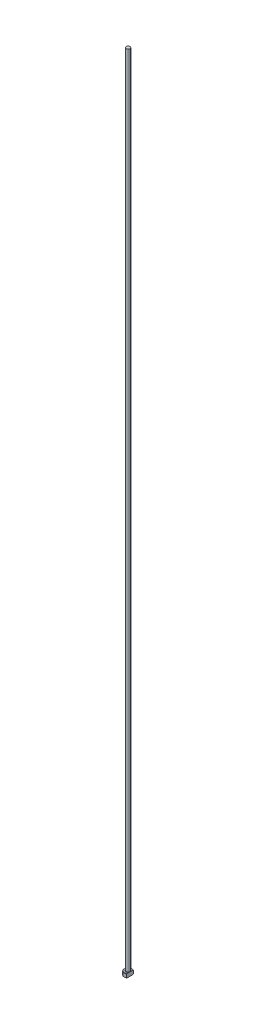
ISO-10303-21;
HEADER;
FILE_DESCRIPTION(('STEP AP214'),'2;1');
FILE_NAME('part.step','',(''),(''),'','','');
FILE_SCHEMA(('AUTOMOTIVE_DESIGN { 1 0 10303 214 1 1 1 1 }'));
ENDSEC;
DATA;
#1=APPLICATION_CONTEXT('core data for automotive mechanical design processes');
#2=APPLICATION_PROTOCOL_DEFINITION('international standard','automotive_design',2000,#1);
#3=PRODUCT_CONTEXT('',#1,'mechanical');
#4=PRODUCT('Part','Part','',(#3));
#5=PRODUCT_RELATED_PRODUCT_CATEGORY('part','',(#4));
#6=PRODUCT_DEFINITION_FORMATION('','',#4);
#7=PRODUCT_DEFINITION_CONTEXT('part definition',#1,'design');
#8=PRODUCT_DEFINITION('design','',#6,#7);
#9=PRODUCT_DEFINITION_SHAPE('','',#8);
#10=(LENGTH_UNIT() NAMED_UNIT(*) SI_UNIT(.MILLI.,.METRE.));
#11=(NAMED_UNIT(*) PLANE_ANGLE_UNIT() SI_UNIT($,.RADIAN.));
#12=(NAMED_UNIT(*) SI_UNIT($,.STERADIAN.) SOLID_ANGLE_UNIT());
#13=UNCERTAINTY_MEASURE_WITH_UNIT(LENGTH_MEASURE(1.E-05),#10,'distance_accuracy_value','');
#14=(GEOMETRIC_REPRESENTATION_CONTEXT(3) GLOBAL_UNCERTAINTY_ASSIGNED_CONTEXT((#13)) GLOBAL_UNIT_ASSIGNED_CONTEXT((#10,
#11,#12)) REPRESENTATION_CONTEXT('',''));
#15=CARTESIAN_POINT('',(0.,0.,0.));
#16=DIRECTION('',(0.,0.,1.));
#17=DIRECTION('',(1.,0.,0.));
#18=AXIS2_PLACEMENT_3D('',#15,#16,#17);
#19=CARTESIAN_POINT('',(0.,0.,0.));
#20=DIRECTION('',(0.,-1.,0.));
#21=DIRECTION('',(0.,0.,-1.));
#22=AXIS2_PLACEMENT_3D('',#19,#20,#21);
#23=PLANE('',#22);
#24=CARTESIAN_POINT('',(0.,0.,0.));
#25=DIRECTION('',(0.,-1.,0.));
#26=DIRECTION('',(0.,0.,-1.));
#27=AXIS2_PLACEMENT_3D('',#24,#25,#26);
#28=CIRCLE('',#27,2.79999999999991);
#29=CARTESIAN_POINT('',(1.49999999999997,0.,2.3643180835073));
#30=VERTEX_POINT('',#29);
#31=CARTESIAN_POINT('',(1.49999999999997,0.,-2.3643180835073));
#32=VERTEX_POINT('',#31);
#33=EDGE_CURVE('E98',#30,#32,#28,.T.);
#34=ORIENTED_EDGE('',*,*,#33,.T.);
#35=DIRECTION('',(0.,0.,1.));
#36=VECTOR('',#35,1.);
#37=CARTESIAN_POINT('',(1.49999999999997,0.,-2.5980762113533));
#38=LINE('',#37,#36);
#39=EDGE_CURVE('E83',#32,#30,#38,.T.);
#40=ORIENTED_EDGE('',*,*,#39,.T.);
#41=EDGE_LOOP('',(#34,#40));
#42=FACE_BOUND('',#41,.T.);
#43=ADVANCED_FACE('F32',(#42),#23,.T.);
#44=CARTESIAN_POINT('',(0.,259.958771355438,0.));
#45=DIRECTION('',(0.,1.,0.));
#46=DIRECTION('',(0.,0.,1.));
#47=AXIS2_PLACEMENT_3D('',#44,#45,#46);
#48=CYLINDRICAL_SURFACE('',#47,2.99999999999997);
#49=CARTESIAN_POINT('',(0.,2.79999999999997,0.));
#50=DIRECTION('',(0.,1.,0.));
#51=DIRECTION('',(0.,0.,1.));
#52=AXIS2_PLACEMENT_3D('',#49,#50,#51);
#53=CIRCLE('',#52,2.99999999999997);
#54=CARTESIAN_POINT('',(1.49999999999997,2.79999999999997,2.5980762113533));
#55=VERTEX_POINT('',#54);
#56=CARTESIAN_POINT('',(1.49999999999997,2.79999999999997,-2.5980762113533));
#57=VERTEX_POINT('',#56);
#58=EDGE_CURVE('E104',#55,#57,#53,.F.);
#59=ORIENTED_EDGE('',*,*,#58,.T.);
#60=DIRECTION('',(0.,-1.,0.));
#61=VECTOR('',#60,1.);
#62=CARTESIAN_POINT('',(1.49999999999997,630.,-2.5980762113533));
#63=LINE('',#62,#61);
#64=CARTESIAN_POINT('',(1.49999999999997,0.200000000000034,-2.5980762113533));
#65=VERTEX_POINT('',#64);
#66=EDGE_CURVE('E183',#57,#65,#63,.T.);
#67=ORIENTED_EDGE('',*,*,#66,.T.);
#68=CARTESIAN_POINT('',(0.,0.200000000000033,0.));
#69=DIRECTION('',(0.,-1.,0.));
#70=DIRECTION('',(0.,0.,-1.));
#71=AXIS2_PLACEMENT_3D('',#68,#69,#70);
#72=CIRCLE('',#71,2.99999999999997);
#73=CARTESIAN_POINT('',(1.49999999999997,0.200000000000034,2.5980762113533));
#74=VERTEX_POINT('',#73);
#75=EDGE_CURVE('E100',#65,#74,#72,.F.);
#76=ORIENTED_EDGE('',*,*,#75,.T.);
#77=DIRECTION('',(0.,-1.,0.));
#78=VECTOR('',#77,1.);
#79=CARTESIAN_POINT('',(1.49999999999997,630.,2.5980762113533));
#80=LINE('',#79,#78);
#81=EDGE_CURVE('E93',#55,#74,#80,.T.);
#82=ORIENTED_EDGE('',*,*,#81,.F.);
#83=EDGE_LOOP('',(#59,#67,#76,#82));
#84=FACE_BOUND('',#83,.T.);
#85=ADVANCED_FACE('F158',(#84),#48,.T.);
#86=CARTESIAN_POINT('',(-2.99999999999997,3.,0.));
#87=DIRECTION('',(0.,1.,0.));
#88=DIRECTION('',(0.,0.,1.));
#89=AXIS2_PLACEMENT_3D('',#86,#87,#88);
#90=PLANE('',#89);
#91=CARTESIAN_POINT('',(0.,3.,0.));
#92=DIRECTION('',(0.,1.,0.));
#93=DIRECTION('',(0.,0.,1.));
#94=AXIS2_PLACEMENT_3D('',#91,#92,#93);
#95=CIRCLE('',#94,2.79999999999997);
#96=CARTESIAN_POINT('',(1.49999999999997,3.,-2.36431808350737));
#97=VERTEX_POINT('',#96);
#98=CARTESIAN_POINT('',(1.49999999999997,3.,2.36431808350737));
#99=VERTEX_POINT('',#98);
#100=EDGE_CURVE('E178',#97,#99,#95,.T.);
#101=ORIENTED_EDGE('',*,*,#100,.T.);
#102=DIRECTION('',(0.,0.,-1.));
#103=VECTOR('',#102,1.);
#104=CARTESIAN_POINT('',(1.49999999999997,3.,0.));
#105=LINE('',#104,#103);
#106=CARTESIAN_POINT('',(1.49999999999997,2.99999999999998,0.799999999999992));
#107=VERTEX_POINT('',#106);
#108=EDGE_CURVE('E57',#99,#107,#105,.T.);
#109=ORIENTED_EDGE('',*,*,#108,.T.);
#110=CARTESIAN_POINT('',(0.,3.,0.));
#111=DIRECTION('',(0.,1.,0.));
#112=DIRECTION('',(0.,0.,1.));
#113=AXIS2_PLACEMENT_3D('',#110,#111,#112);
#114=CIRCLE('',#113,1.69999999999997);
#115=CARTESIAN_POINT('',(1.49999999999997,2.99999999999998,-0.799999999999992));
#116=VERTEX_POINT('',#115);
#117=EDGE_CURVE('E107',#107,#116,#114,.F.);
#118=ORIENTED_EDGE('',*,*,#117,.T.);
#119=EDGE_CURVE('E136',#116,#97,#105,.T.);
#120=ORIENTED_EDGE('',*,*,#119,.T.);
#121=EDGE_LOOP('',(#101,#109,#118,#120));
#122=FACE_BOUND('',#121,.T.);
#123=ADVANCED_FACE('F147',(#122),#90,.T.);
#124=CARTESIAN_POINT('',(0.,3.,0.));
#125=DIRECTION('',(0.,-1.,0.));
#126=DIRECTION('',(0.,0.,-1.));
#127=AXIS2_PLACEMENT_3D('',#124,#125,#126);
#128=CONICAL_SURFACE('',#127,2.79999999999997,0.785398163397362);
#129=ORIENTED_EDGE('',*,*,#58,.F.);
#130=CARTESIAN_POINT('',(1.49999999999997,-0.111741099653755,5.71827621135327));
#131=CARTESIAN_POINT('',(1.49999999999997,0.0136183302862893,5.58866816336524));
#132=CARTESIAN_POINT('',(1.49999999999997,0.138843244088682,5.45892957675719));
#133=CARTESIAN_POINT('',(1.49999999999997,0.388944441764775,5.19911365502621));
#134=CARTESIAN_POINT('',(1.49999999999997,0.513820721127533,5.0690363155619));
#135=CARTESIAN_POINT('',(1.49999999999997,0.76320568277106,4.80840180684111));
#136=CARTESIAN_POINT('',(1.49999999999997,0.88771414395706,4.67784442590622));
#137=CARTESIAN_POINT('',(1.49999999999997,1.13618059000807,4.41620813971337));
#138=CARTESIAN_POINT('',(1.49999999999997,1.26013857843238,4.28512923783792));
#139=CARTESIAN_POINT('',(1.49999999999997,1.50488975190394,4.02490837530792));
#140=CARTESIAN_POINT('',(1.49999999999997,1.62569693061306,3.89577958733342));
#141=CARTESIAN_POINT('',(1.49999999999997,1.86640694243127,3.63668213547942));
#142=CARTESIAN_POINT('',(1.49999999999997,1.98630978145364,3.50671347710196));
#143=CARTESIAN_POINT('',(1.49999999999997,2.22486033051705,3.24567921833));
#144=CARTESIAN_POINT('',(1.49999999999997,2.34350830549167,3.11461386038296));
#145=CARTESIAN_POINT('',(1.49999999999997,2.57907716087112,2.85094268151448));
#146=CARTESIAN_POINT('',(1.49999999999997,2.69599811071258,2.71833692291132));
#147=CARTESIAN_POINT('',(1.49999999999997,2.88262371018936,2.50255231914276));
#148=CARTESIAN_POINT('',(1.49999999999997,2.95312454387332,2.42006293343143));
#149=CARTESIAN_POINT('',(1.49999999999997,3.09287098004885,2.25401084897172));
#150=CARTESIAN_POINT('',(1.49999999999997,3.16211645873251,2.17044804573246));
#151=CARTESIAN_POINT('',(1.49999999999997,3.29964684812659,2.00105967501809));
#152=CARTESIAN_POINT('',(1.49999999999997,3.36791386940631,1.91521952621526));
#153=CARTESIAN_POINT('',(1.49999999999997,3.50205840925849,1.74171392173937));
#154=CARTESIAN_POINT('',(1.49999999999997,3.56793649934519,1.65404891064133));
#155=CARTESIAN_POINT('',(1.49999999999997,3.69728151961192,1.47490236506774));
#156=CARTESIAN_POINT('',(1.49999999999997,3.76069661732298,1.38338308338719));
#157=CARTESIAN_POINT('',(1.49999999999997,3.88239539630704,1.19675661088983));
#158=CARTESIAN_POINT('',(1.49999999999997,3.94067201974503,1.10164473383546));
#159=CARTESIAN_POINT('',(1.49999999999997,4.04841325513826,0.908008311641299));
#160=CARTESIAN_POINT('',(1.49999999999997,4.09797809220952,0.809540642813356));
#161=CARTESIAN_POINT('',(1.49999999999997,4.18432188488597,0.607192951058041));
#162=CARTESIAN_POINT('',(1.49999999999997,4.22114374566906,0.503332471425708));
#163=CARTESIAN_POINT('',(1.49999999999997,4.26099935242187,0.347577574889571));
#164=CARTESIAN_POINT('',(1.49999999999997,4.27157029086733,0.297609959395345));
#165=CARTESIAN_POINT('',(1.49999999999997,4.2879486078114,0.196885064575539));
#166=CARTESIAN_POINT('',(1.49999999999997,4.2937564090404,0.146127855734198));
#167=CARTESIAN_POINT('',(1.49999999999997,4.30019707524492,0.0444388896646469));
#168=CARTESIAN_POINT('',(1.49999999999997,4.30084594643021,-0.00649183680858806));
#169=CARTESIAN_POINT('',(1.49999999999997,4.29696416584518,-0.108155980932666));
#170=CARTESIAN_POINT('',(1.49999999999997,4.29243308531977,-0.158889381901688));
#171=CARTESIAN_POINT('',(1.49999999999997,4.27856915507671,-0.259234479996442));
#172=CARTESIAN_POINT('',(1.49999999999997,4.2692782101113,-0.308852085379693));
#173=CARTESIAN_POINT('',(1.49999999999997,4.24647108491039,-0.407110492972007));
#174=CARTESIAN_POINT('',(1.49999999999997,4.23295324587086,-0.455750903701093));
#175=CARTESIAN_POINT('',(1.49999999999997,4.20226175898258,-0.552149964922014));
#176=CARTESIAN_POINT('',(1.49999999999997,4.18506801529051,-0.599902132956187));
#177=CARTESIAN_POINT('',(1.49999999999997,4.14771387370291,-0.694205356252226));
#178=CARTESIAN_POINT('',(1.49999999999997,4.12755408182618,-0.74075665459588));
#179=CARTESIAN_POINT('',(1.49999999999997,4.06327696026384,-0.879166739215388));
#180=CARTESIAN_POINT('',(1.49999999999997,4.01551721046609,-0.969329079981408));
#181=CARTESIAN_POINT('',(1.49999999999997,3.91367909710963,-1.14604316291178));
#182=CARTESIAN_POINT('',(1.49999999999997,3.85959300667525,-1.23259031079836));
#183=CARTESIAN_POINT('',(1.49999999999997,3.74697968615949,-1.40321348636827));
#184=CARTESIAN_POINT('',(1.49999999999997,3.68843573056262,-1.48727838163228));
#185=CARTESIAN_POINT('',(1.49999999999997,3.56843845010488,-1.65322187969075));
#186=CARTESIAN_POINT('',(1.49999999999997,3.50698656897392,-1.73510153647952));
#187=CARTESIAN_POINT('',(1.49999999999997,3.38115673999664,-1.89829823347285));
#188=CARTESIAN_POINT('',(1.49999999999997,3.31675092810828,-1.97959369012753));
#189=CARTESIAN_POINT('',(1.49999999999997,3.18634068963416,-2.14090082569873));
#190=CARTESIAN_POINT('',(1.49999999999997,3.12033609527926,-2.22091236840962));
#191=CARTESIAN_POINT('',(1.49999999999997,2.92086431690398,-2.4590650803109));
#192=CARTESIAN_POINT('',(1.49999999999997,2.7856266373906,-2.61572090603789));
#193=CARTESIAN_POINT('',(1.49999999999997,2.53554498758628,-2.90006295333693));
#194=CARTESIAN_POINT('',(1.49999999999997,2.42114543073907,-3.02814382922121));
#195=CARTESIAN_POINT('',(1.49999999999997,2.19093557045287,-3.28303767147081));
#196=CARTESIAN_POINT('',(1.49999999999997,2.07512522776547,-3.40985060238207));
#197=CARTESIAN_POINT('',(1.49999999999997,1.72597067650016,-3.7891384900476));
#198=CARTESIAN_POINT('',(1.49999999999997,1.49111760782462,-4.04022177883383));
#199=CARTESIAN_POINT('',(1.49999999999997,1.02882478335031,-4.52992803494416));
#200=CARTESIAN_POINT('',(1.49999999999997,0.801477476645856,-4.76863870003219));
#201=CARTESIAN_POINT('',(1.49999999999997,0.459548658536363,-5.12558036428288));
#202=CARTESIAN_POINT('',(1.49999999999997,0.345484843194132,-5.24430773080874));
#203=CARTESIAN_POINT('',(1.49999999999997,0.11707176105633,-5.48148573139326));
#204=CARTESIAN_POINT('',(1.49999999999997,0.00272249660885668,-5.59993636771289));
#205=CARTESIAN_POINT('',(1.49999999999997,-0.111741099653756,-5.71827621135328));
#206=B_SPLINE_CURVE_WITH_KNOTS('',3,(#130,#131,#132,#133,#134,#135,#136,#137,#138,#139,#140,
#141,#142,#143,#144,#145,#146,#147,#148,#149,#150,#151,#152,#153,#154,#155,#156,#157,#158,#159,
#160,#161,#162,#163,#164,#165,#166,#167,#168,#169,#170,#171,#172,#173,#174,#175,#176,#177,#178,
#179,#180,#181,#182,#183,#184,#185,#186,#187,#188,#189,#190,#191,#192,#193,#194,#195,#196,#197,
#198,#199,#200,#201,#202,#203,#204,#205),.UNSPECIFIED.,.F.,.F.,(4,2,2,2,2,2,2,2,2,2,2,2,2,2,2,2,
2,2,2,2,2,2,2,2,2,2,2,2,2,2,2,2,2,2,2,2,2,4),(0.,0.540943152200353,1.08189327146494,
1.62312052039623,2.16434426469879,2.69482920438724,3.22531067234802,3.7556778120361,
4.28602356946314,4.61155053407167,4.93710943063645,5.26610945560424,5.59503024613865,
5.92894782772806,6.26331713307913,6.59354403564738,6.92264800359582,7.07567478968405,
7.22868799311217,7.38122626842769,7.53377717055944,7.68500755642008,7.83629736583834,
7.98843643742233,8.14054446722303,8.44618799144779,8.75220879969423,9.05944044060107,
9.3665211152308,9.67764287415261,9.98879742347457,10.6095925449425,11.1247803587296,
11.6399825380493,12.6713544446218,13.6603005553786,14.1542238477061,14.6481430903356),.UNSPECIFIED.);
#207=EDGE_CURVE('E135',#55,#99,#206,.T.);
#208=ORIENTED_EDGE('',*,*,#207,.T.);
#209=ORIENTED_EDGE('',*,*,#100,.F.);
#210=EDGE_CURVE('E127',#97,#57,#206,.T.);
#211=ORIENTED_EDGE('',*,*,#210,.T.);
#212=EDGE_LOOP('',(#129,#208,#209,#211));
#213=FACE_BOUND('',#212,.T.);
#214=ADVANCED_FACE('F143',(#213),#128,.T.);
#215=CARTESIAN_POINT('',(0.,0.200000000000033,0.));
#216=DIRECTION('',(0.,1.,0.));
#217=DIRECTION('',(0.,0.,1.));
#218=AXIS2_PLACEMENT_3D('',#215,#216,#217);
#219=CONICAL_SURFACE('',#218,2.99999999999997,0.7853981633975);
#220=ORIENTED_EDGE('',*,*,#75,.F.);
#221=CARTESIAN_POINT('',(1.49999999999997,3.11174109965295,-5.71827621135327));
#222=CARTESIAN_POINT('',(1.49999999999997,2.98638166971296,-5.58866816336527));
#223=CARTESIAN_POINT('',(1.49999999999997,2.86115675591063,-5.45892957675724));
#224=CARTESIAN_POINT('',(1.49999999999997,2.61105555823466,-5.19911365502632));
#225=CARTESIAN_POINT('',(1.49999999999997,2.48617927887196,-5.06903631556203));
#226=CARTESIAN_POINT('',(1.49999999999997,2.23679431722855,-4.8084018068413));
#227=CARTESIAN_POINT('',(1.49999999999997,2.11228585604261,-4.67784442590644));
#228=CARTESIAN_POINT('',(1.49999999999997,1.86381940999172,-4.41620813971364));
#229=CARTESIAN_POINT('',(1.49999999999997,1.73986142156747,-4.28512923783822));
#230=CARTESIAN_POINT('',(1.49999999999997,1.49511024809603,-4.02490837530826));
#231=CARTESIAN_POINT('',(1.49999999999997,1.37430306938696,-3.89577958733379));
#232=CARTESIAN_POINT('',(1.49999999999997,1.13359305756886,-3.63668213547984));
#233=CARTESIAN_POINT('',(1.49999999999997,1.01369021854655,-3.5067134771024));
#234=CARTESIAN_POINT('',(1.49999999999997,0.775139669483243,-3.24567921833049));
#235=CARTESIAN_POINT('',(1.49999999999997,0.656491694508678,-3.11461386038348));
#236=CARTESIAN_POINT('',(1.49999999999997,0.42092283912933,-2.85094268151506));
#237=CARTESIAN_POINT('',(1.49999999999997,0.304001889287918,-2.71833692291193));
#238=CARTESIAN_POINT('',(1.49999999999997,0.117376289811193,-2.50255231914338));
#239=CARTESIAN_POINT('',(1.49999999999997,0.0468754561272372,-2.42006293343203));
#240=CARTESIAN_POINT('',(1.49999999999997,-0.0928709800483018,-2.25401084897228));
#241=CARTESIAN_POINT('',(1.49999999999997,-0.162116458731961,-2.170448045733));
#242=CARTESIAN_POINT('',(1.49999999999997,-0.299646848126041,-2.0010596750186));
#243=CARTESIAN_POINT('',(1.49999999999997,-0.36791386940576,-1.91521952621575));
#244=CARTESIAN_POINT('',(1.49999999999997,-0.502058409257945,-1.74171392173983));
#245=CARTESIAN_POINT('',(1.49999999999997,-0.567936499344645,-1.65404891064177));
#246=CARTESIAN_POINT('',(1.49999999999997,-0.697281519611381,-1.47490236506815));
#247=CARTESIAN_POINT('',(1.49999999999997,-0.760696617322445,-1.38338308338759));
#248=CARTESIAN_POINT('',(1.49999999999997,-0.882395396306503,-1.1967566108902));
#249=CARTESIAN_POINT('',(1.49999999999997,-0.940672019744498,-1.10164473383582));
#250=CARTESIAN_POINT('',(1.49999999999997,-1.04841325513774,-0.908008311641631));
#251=CARTESIAN_POINT('',(1.49999999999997,-1.09797809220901,-0.809540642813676));
#252=CARTESIAN_POINT('',(1.49999999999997,-1.18432188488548,-0.607192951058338));
#253=CARTESIAN_POINT('',(1.49999999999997,-1.22114374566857,-0.503332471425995));
#254=CARTESIAN_POINT('',(1.49999999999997,-1.2609993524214,-0.347577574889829));
#255=CARTESIAN_POINT('',(1.49999999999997,-1.27157029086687,-0.297609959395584));
#256=CARTESIAN_POINT('',(1.49999999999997,-1.28794860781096,-0.196885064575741));
#257=CARTESIAN_POINT('',(1.49999999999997,-1.29375640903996,-0.14612785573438));
#258=CARTESIAN_POINT('',(1.49999999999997,-1.3001970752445,-0.0444388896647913));
#259=CARTESIAN_POINT('',(1.49999999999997,-1.30084594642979,0.00649183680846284));
#260=CARTESIAN_POINT('',(1.49999999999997,-1.29696416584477,0.10815598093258));
#261=CARTESIAN_POINT('',(1.49999999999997,-1.29243308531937,0.158889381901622));
#262=CARTESIAN_POINT('',(1.49999999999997,-1.2785691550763,0.259234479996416));
#263=CARTESIAN_POINT('',(1.49999999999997,-1.26927821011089,0.308852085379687));
#264=CARTESIAN_POINT('',(1.49999999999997,-1.24647108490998,0.40711049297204));
#265=CARTESIAN_POINT('',(1.49999999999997,-1.23295324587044,0.455750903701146));
#266=CARTESIAN_POINT('',(1.49999999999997,-1.20226175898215,0.552149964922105));
#267=CARTESIAN_POINT('',(1.49999999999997,-1.18506801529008,0.599902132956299));
#268=CARTESIAN_POINT('',(1.49999999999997,-1.14771387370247,0.694205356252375));
#269=CARTESIAN_POINT('',(1.49999999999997,-1.12755408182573,0.740756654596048));
#270=CARTESIAN_POINT('',(1.49999999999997,-1.06327696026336,0.879166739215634));
#271=CARTESIAN_POINT('',(1.49999999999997,-1.01551721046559,0.969329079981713));
#272=CARTESIAN_POINT('',(1.49999999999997,-0.913679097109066,1.1460431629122));
#273=CARTESIAN_POINT('',(1.49999999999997,-0.859593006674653,1.23259031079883));
#274=CARTESIAN_POINT('',(1.49999999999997,-0.746979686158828,1.40321348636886));
#275=CARTESIAN_POINT('',(1.49999999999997,-0.688435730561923,1.48727838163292));
#276=CARTESIAN_POINT('',(1.49999999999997,-0.568438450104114,1.6532218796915));
#277=CARTESIAN_POINT('',(1.49999999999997,-0.506986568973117,1.73510153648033));
#278=CARTESIAN_POINT('',(1.49999999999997,-0.381156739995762,1.89829823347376));
#279=CARTESIAN_POINT('',(1.49999999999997,-0.316750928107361,1.9795936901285));
#280=CARTESIAN_POINT('',(1.49999999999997,-0.186340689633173,2.14090082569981));
#281=CARTESIAN_POINT('',(1.49999999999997,-0.120336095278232,2.22091236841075));
#282=CARTESIAN_POINT('',(1.49999999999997,0.0791356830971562,2.45906508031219));
#283=CARTESIAN_POINT('',(1.49999999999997,0.214373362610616,2.61572090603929));
#284=CARTESIAN_POINT('',(1.49999999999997,0.464455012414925,2.90006295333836));
#285=CARTESIAN_POINT('',(1.49999999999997,0.578854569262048,3.02814382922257));
#286=CARTESIAN_POINT('',(1.49999999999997,0.809064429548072,3.28303767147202));
#287=CARTESIAN_POINT('',(1.49999999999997,0.924874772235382,3.40985060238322));
#288=CARTESIAN_POINT('',(1.49999999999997,1.27402932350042,3.78913849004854));
#289=CARTESIAN_POINT('',(1.49999999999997,1.50888239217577,4.04022177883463));
#290=CARTESIAN_POINT('',(1.49999999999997,1.97117521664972,4.52992803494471));
#291=CARTESIAN_POINT('',(1.49999999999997,2.19852252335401,4.76863870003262));
#292=CARTESIAN_POINT('',(1.49999999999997,2.54045134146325,5.12558036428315));
#293=CARTESIAN_POINT('',(1.49999999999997,2.6545151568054,5.24430773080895));
#294=CARTESIAN_POINT('',(1.49999999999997,2.88292823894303,5.48148573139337));
#295=CARTESIAN_POINT('',(1.49999999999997,2.99727750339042,5.59993636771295));
#296=CARTESIAN_POINT('',(1.49999999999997,3.11174109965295,5.71827621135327));
#297=B_SPLINE_CURVE_WITH_KNOTS('',3,(#221,#222,#223,#224,#225,#226,#227,#228,#229,#230,#231,
#232,#233,#234,#235,#236,#237,#238,#239,#240,#241,#242,#243,#244,#245,#246,#247,#248,#249,#250,
#251,#252,#253,#254,#255,#256,#257,#258,#259,#260,#261,#262,#263,#264,#265,#266,#267,#268,#269,
#270,#271,#272,#273,#274,#275,#276,#277,#278,#279,#280,#281,#282,#283,#284,#285,#286,#287,#288,
#289,#290,#291,#292,#293,#294,#295,#296),.UNSPECIFIED.,.F.,.F.,(4,2,2,2,2,2,2,2,2,2,2,2,2,2,2,2,
2,2,2,2,2,2,2,2,2,2,2,2,2,2,2,2,2,2,2,2,2,4),(0.,0.540943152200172,1.08189327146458,
1.62312052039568,2.16434426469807,2.69482920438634,3.22531067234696,3.75567781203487,
4.28602356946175,4.61155053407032,4.93710943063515,5.26610945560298,5.59503024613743,
5.92894782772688,6.26331713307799,6.59354403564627,6.92264800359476,7.07567478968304,
7.22868799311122,7.38122626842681,7.53377717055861,7.68500755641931,7.83629736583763,
7.98843643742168,8.14054446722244,8.44618799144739,8.75220879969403,9.05944044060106,
9.36652111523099,9.67764287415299,9.98879742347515,10.6095925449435,11.1247803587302,
11.6399825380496,12.6713544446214,13.6603005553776,14.1542238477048,14.648143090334),.UNSPECIFIED.);
#298=EDGE_CURVE('E86',#65,#32,#297,.T.);
#299=ORIENTED_EDGE('',*,*,#298,.T.);
#300=ORIENTED_EDGE('',*,*,#33,.F.);
#301=EDGE_CURVE('E89',#30,#74,#297,.T.);
#302=ORIENTED_EDGE('',*,*,#301,.T.);
#303=EDGE_LOOP('',(#220,#299,#300,#302));
#304=FACE_BOUND('',#303,.T.);
#305=ADVANCED_FACE('F97',(#304),#219,.T.);
#306=CARTESIAN_POINT('',(0.,3.19999999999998,0.));
#307=DIRECTION('',(0.,1.,0.));
#308=DIRECTION('',(0.,0.,1.));
#309=AXIS2_PLACEMENT_3D('',#306,#307,#308);
#310=TOROIDAL_SURFACE('',#309,1.69999999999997,0.2);
#311=CARTESIAN_POINT('',(1.49999999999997,3.19999999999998,0.));
#312=CARTESIAN_POINT('',(1.49999999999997,3.20000050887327,7.14686524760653E-11));
#313=CARTESIAN_POINT('',(1.49999999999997,3.20000101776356,-1.21663671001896E-07));
#314=CARTESIAN_POINT('',(1.49999999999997,3.20000199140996,-4.97616231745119E-07));
#315=CARTESIAN_POINT('',(1.49999999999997,3.20000245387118,-7.56516213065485E-07));
#316=CARTESIAN_POINT('',(1.49999999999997,3.20000338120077,-1.37642836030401E-06));
#317=CARTESIAN_POINT('',(1.49999999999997,3.20000384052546,-1.74563475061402E-06));
#318=CARTESIAN_POINT('',(1.49999999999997,3.20000469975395,-2.53565983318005E-06));
#319=CARTESIAN_POINT('',(1.49999999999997,3.20000510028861,-2.95582595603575E-06));
#320=CARTESIAN_POINT('',(1.49999999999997,3.20000646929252,-4.48430443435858E-06));
#321=CARTESIAN_POINT('',(1.49999999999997,3.20000736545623,-5.6586103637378E-06));
#322=CARTESIAN_POINT('',(1.49999999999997,3.20000893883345,-8.06479198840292E-06));
#323=CARTESIAN_POINT('',(1.49999999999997,3.20000962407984,-9.29170513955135E-06));
#324=CARTESIAN_POINT('',(1.49999999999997,3.2000122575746,-1.41623288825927E-05));
#325=CARTESIAN_POINT('',(1.49999999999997,3.20001407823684,-1.78790031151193E-05));
#326=CARTESIAN_POINT('',(1.49999999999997,3.20001699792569,-2.51443065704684E-05));
#327=CARTESIAN_POINT('',(1.49999999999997,3.20001815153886,-2.86715393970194E-05));
#328=CARTESIAN_POINT('',(1.49999999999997,3.20002315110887,-4.39218127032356E-05));
#329=CARTESIAN_POINT('',(1.49999999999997,3.2000270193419,-5.56288388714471E-05));
#330=CARTESIAN_POINT('',(1.49999999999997,3.20003312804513,-7.74058287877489E-05));
#331=CARTESIAN_POINT('',(1.49999999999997,3.20003553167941,-8.7427840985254E-05));
#332=CARTESIAN_POINT('',(1.49999999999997,3.20005483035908,-0.00016122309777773));
#333=CARTESIAN_POINT('',(1.49999999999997,3.2000797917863,-0.000222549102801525));
#334=CARTESIAN_POINT('',(1.49999999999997,3.20017391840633,-0.000462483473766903));
#335=CARTESIAN_POINT('',(1.49999999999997,3.20023706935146,-0.000642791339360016));
#336=CARTESIAN_POINT('',(1.49999999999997,3.20048761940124,-0.00134785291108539));
#337=CARTESIAN_POINT('',(1.49999999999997,3.20068132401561,-0.00187087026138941));
#338=CARTESIAN_POINT('',(1.49999999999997,3.20147357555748,-0.0040200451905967));
#339=CARTESIAN_POINT('',(1.49999999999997,3.20206499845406,-0.00564811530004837));
#340=CARTESIAN_POINT('',(1.49999999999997,3.2089263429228,-0.0245232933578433));
#341=CARTESIAN_POINT('',(1.49999999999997,3.21523683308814,-0.0417598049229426));
#342=CARTESIAN_POINT('',(1.49999999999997,3.22755028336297,-0.0756091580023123));
#343=CARTESIAN_POINT('',(1.49999999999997,3.23355589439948,-0.0922211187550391));
#344=CARTESIAN_POINT('',(1.49999999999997,3.2462010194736,-0.127454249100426));
#345=CARTESIAN_POINT('',(1.49999999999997,3.25283080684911,-0.146078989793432));
#346=CARTESIAN_POINT('',(1.49999999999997,3.26599765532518,-0.183577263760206));
#347=CARTESIAN_POINT('',(1.49999999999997,3.2725330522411,-0.202451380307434));
#348=CARTESIAN_POINT('',(1.49999999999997,3.28834228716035,-0.248982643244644));
#349=CARTESIAN_POINT('',(1.49999999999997,3.29749152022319,-0.276682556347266));
#350=CARTESIAN_POINT('',(1.49999999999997,3.3149093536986,-0.331625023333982));
#351=CARTESIAN_POINT('',(1.49999999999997,3.32319386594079,-0.358862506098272));
#352=CARTESIAN_POINT('',(1.49999999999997,3.34051594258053,-0.419125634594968));
#353=CARTESIAN_POINT('',(1.49999999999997,3.34936607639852,-0.452206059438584));
#354=CARTESIAN_POINT('',(1.49999999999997,3.36549583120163,-0.519023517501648));
#355=CARTESIAN_POINT('',(1.49999999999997,3.37276283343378,-0.552763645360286));
#356=CARTESIAN_POINT('',(1.49999999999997,3.38554755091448,-0.623053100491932));
#357=CARTESIAN_POINT('',(1.49999999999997,3.39090573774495,-0.659632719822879));
#358=CARTESIAN_POINT('',(1.49999999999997,3.39825016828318,-0.733028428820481));
#359=CARTESIAN_POINT('',(1.49999999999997,3.40024734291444,-0.769843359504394));
#360=CARTESIAN_POINT('',(1.49999999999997,3.39970780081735,-0.842856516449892));
#361=CARTESIAN_POINT('',(1.49999999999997,3.39725347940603,-0.87905368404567));
#362=CARTESIAN_POINT('',(1.49999999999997,3.38900085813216,-0.932380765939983));
#363=CARTESIAN_POINT('',(1.49999999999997,3.38553049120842,-0.949868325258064));
#364=CARTESIAN_POINT('',(1.49999999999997,3.37678336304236,-0.98437493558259));
#365=CARTESIAN_POINT('',(1.49999999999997,3.37150943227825,-1.00139467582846));
#366=CARTESIAN_POINT('',(1.49999999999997,3.35869781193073,-1.03479423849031));
#367=CARTESIAN_POINT('',(1.49999999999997,3.3511359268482,-1.05116499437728));
#368=CARTESIAN_POINT('',(1.49999999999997,3.33325333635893,-1.08234828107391));
#369=CARTESIAN_POINT('',(1.49999999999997,3.32294266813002,-1.097166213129));
#370=CARTESIAN_POINT('',(1.49999999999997,3.30512758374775,-1.11714173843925));
#371=CARTESIAN_POINT('',(1.49999999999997,3.29884721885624,-1.1233906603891));
#372=CARTESIAN_POINT('',(1.49999999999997,3.28545950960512,-1.13494695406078));
#373=CARTESIAN_POINT('',(1.49999999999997,3.27835226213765,-1.14025443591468));
#374=CARTESIAN_POINT('',(1.49999999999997,3.26325970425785,-1.14967631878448));
#375=CARTESIAN_POINT('',(1.49999999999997,3.25526534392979,-1.1537764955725));
#376=CARTESIAN_POINT('',(1.49999999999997,3.23863207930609,-1.16034952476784));
#377=CARTESIAN_POINT('',(1.49999999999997,3.22999427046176,-1.16282507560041));
#378=CARTESIAN_POINT('',(1.49999999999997,3.21343922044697,-1.16570267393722));
#379=CARTESIAN_POINT('',(1.49999999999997,3.20555896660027,-1.16631687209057));
#380=CARTESIAN_POINT('',(1.49999999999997,3.18982775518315,-1.16602054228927));
#381=CARTESIAN_POINT('',(1.49999999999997,3.18197679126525,-1.16511036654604));
#382=CARTESIAN_POINT('',(1.49999999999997,3.16747846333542,-1.16204446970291));
#383=CARTESIAN_POINT('',(1.49999999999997,3.16079696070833,-1.16004509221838));
#384=CARTESIAN_POINT('',(1.49999999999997,3.14781700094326,-1.15505972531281));
#385=CARTESIAN_POINT('',(1.49999999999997,3.14151862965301,-1.1520735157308));
#386=CARTESIAN_POINT('',(1.49999999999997,3.12690214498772,-1.14387585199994));
#387=CARTESIAN_POINT('',(1.49999999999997,3.11881436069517,-1.13825400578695));
#388=CARTESIAN_POINT('',(1.49999999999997,3.1036444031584,-1.12578441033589));
#389=CARTESIAN_POINT('',(1.49999999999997,3.09656475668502,-1.11893367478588));
#390=CARTESIAN_POINT('',(1.49999999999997,3.08012297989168,-1.10074342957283));
#391=CARTESIAN_POINT('',(1.49999999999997,3.07136543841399,-1.08886044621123));
#392=CARTESIAN_POINT('',(1.49999999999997,3.05578194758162,-1.06392743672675));
#393=CARTESIAN_POINT('',(1.49999999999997,3.0489571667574,-1.05087671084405));
#394=CARTESIAN_POINT('',(1.49999999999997,3.03273856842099,-1.0147230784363));
#395=CARTESIAN_POINT('',(1.49999999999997,3.02486230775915,-0.990945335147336));
#396=CARTESIAN_POINT('',(1.49999999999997,3.01257693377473,-0.942321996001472));
#397=CARTESIAN_POINT('',(1.49999999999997,3.00820590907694,-0.917467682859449));
#398=CARTESIAN_POINT('',(1.49999999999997,3.00229956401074,-0.867912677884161));
#399=CARTESIAN_POINT('',(1.49999999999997,3.0007128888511,-0.843217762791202));
#400=CARTESIAN_POINT('',(1.49999999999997,2.9996723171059,-0.793746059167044));
#401=CARTESIAN_POINT('',(1.49999999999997,3.0002230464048,-0.768969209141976));
#402=CARTESIAN_POINT('',(1.49999999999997,3.00433101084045,-0.696994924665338));
#403=CARTESIAN_POINT('',(1.49999999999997,3.01016976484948,-0.649931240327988));
#404=CARTESIAN_POINT('',(1.49999999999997,3.02567776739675,-0.559166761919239));
#405=CARTESIAN_POINT('',(1.49999999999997,3.03511950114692,-0.515423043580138));
#406=CARTESIAN_POINT('',(1.49999999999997,3.05693059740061,-0.427590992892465));
#407=CARTESIAN_POINT('',(1.49999999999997,3.0693635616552,-0.383518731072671));
#408=CARTESIAN_POINT('',(1.49999999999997,3.0917495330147,-0.310161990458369));
#409=CARTESIAN_POINT('',(1.49999999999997,3.1011984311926,-0.280718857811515));
#410=CARTESIAN_POINT('',(1.49999999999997,3.12060442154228,-0.22234098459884));
#411=CARTESIAN_POINT('',(1.49999999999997,3.13055519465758,-0.193404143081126));
#412=CARTESIAN_POINT('',(1.49999999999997,3.14973721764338,-0.1387568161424));
#413=CARTESIAN_POINT('',(1.49999999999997,3.15893123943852,-0.113033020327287));
#414=CARTESIAN_POINT('',(1.49999999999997,3.17788037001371,-0.0606351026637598));
#415=CARTESIAN_POINT('',(1.49999999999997,3.18764328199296,-0.0339636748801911));
#416=CARTESIAN_POINT('',(1.49999999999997,3.19793548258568,-0.00564657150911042));
#417=CARTESIAN_POINT('',(1.49999999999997,3.19852751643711,-0.00401699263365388));
#418=CARTESIAN_POINT('',(1.49999999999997,3.1993199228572,-0.00186745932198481));
#419=CARTESIAN_POINT('',(1.49999999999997,3.1995131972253,-0.00134559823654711));
#420=CARTESIAN_POINT('',(1.49999999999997,3.19976322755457,-0.000641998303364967));
#421=CARTESIAN_POINT('',(1.49999999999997,3.19982627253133,-0.000461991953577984));
#422=CARTESIAN_POINT('',(1.49999999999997,3.19992025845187,-0.000222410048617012));
#423=CARTESIAN_POINT('',(1.49999999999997,3.19994519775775,-0.000161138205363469));
#424=CARTESIAN_POINT('',(1.49999999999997,3.1999644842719,-8.74039265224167E-05));
#425=CARTESIAN_POINT('',(1.49999999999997,3.19996688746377,-7.73857554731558E-05));
#426=CARTESIAN_POINT('',(1.49999999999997,3.19997299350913,-5.56173270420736E-05));
#427=CARTESIAN_POINT('',(1.49999999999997,3.19997685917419,-4.39149185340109E-05));
#428=CARTESIAN_POINT('',(1.49999999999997,3.19998185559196,-2.86698156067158E-05));
#429=CARTESIAN_POINT('',(1.49999999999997,3.19998300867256,-2.51431574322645E-05));
#430=CARTESIAN_POINT('',(1.49999999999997,3.19998592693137,-1.78789551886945E-05));
#431=CARTESIAN_POINT('',(1.49999999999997,3.19998774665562,-1.41627846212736E-05));
#432=CARTESIAN_POINT('',(1.49999999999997,3.1999903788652,-9.29264485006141E-06));
#433=CARTESIAN_POINT('',(1.49999999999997,3.19999106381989,-8.06577596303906E-06));
#434=CARTESIAN_POINT('',(1.49999999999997,3.19999263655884,-5.65962636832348E-06));
#435=CARTESIAN_POINT('',(1.49999999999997,3.19999353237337,-4.48530463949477E-06));
#436=CARTESIAN_POINT('',(1.49999999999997,3.19999490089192,-2.95673739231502E-06));
#437=CARTESIAN_POINT('',(1.49999999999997,3.19999530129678,-2.53653206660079E-06));
#438=CARTESIAN_POINT('',(1.49999999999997,3.19999616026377,-1.74640524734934E-06));
#439=CARTESIAN_POINT('',(1.49999999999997,3.19999661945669,-1.37713597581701E-06));
#440=CARTESIAN_POINT('',(1.49999999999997,3.19999754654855,-7.57072329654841E-07));
#441=CARTESIAN_POINT('',(1.49999999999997,3.1999980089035,-4.98087382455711E-07));
#442=CARTESIAN_POINT('',(1.49999999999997,3.19999898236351,-1.21927247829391E-07));
#443=CARTESIAN_POINT('',(1.49999999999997,3.19999949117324,-7.14621145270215E-11));
#444=CARTESIAN_POINT('',(1.49999999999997,3.19999999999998,0.));
#445=B_SPLINE_CURVE_WITH_KNOTS('',3,(#311,#312,#313,#314,#315,#316,#317,#318,#319,#320,#321,
#322,#323,#324,#325,#326,#327,#328,#329,#330,#331,#332,#333,#334,#335,#336,#337,#338,#339,#340,
#341,#342,#343,#344,#345,#346,#347,#348,#349,#350,#351,#352,#353,#354,#355,#356,#357,#358,#359,
#360,#361,#362,#363,#364,#365,#366,#367,#368,#369,#370,#371,#372,#373,#374,#375,#376,#377,#378,
#379,#380,#381,#382,#383,#384,#385,#386,#387,#388,#389,#390,#391,#392,#393,#394,#395,#396,#397,
#398,#399,#400,#401,#402,#403,#404,#405,#406,#407,#408,#409,#410,#411,#412,#413,#414,#415,#416,
#417,#418,#419,#420,#421,#422,#423,#424,#425,#426,#427,#428,#429,#430,#431,#432,#433,#434,#435,
#436,#437,#438,#439,#440,#441,#442,#443,#444),.UNSPECIFIED.,.T.,.F.,(4,2,2,2,2,2,2,2,2,2,2,2,2,
2,2,2,2,2,2,2,2,2,2,2,2,2,2,2,2,2,2,2,2,2,2,2,2,2,2,2,2,2,2,2,2,2,2,2,2,2,2,2,2,2,2,2,2,2,2,2,2,
2,2,2,2,2,4),(0.,1.5268750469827E-06,3.1095939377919E-06,4.8697676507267E-06,
6.6094009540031E-06,1.1020252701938E-05,1.52327800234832E-05,2.76140373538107E-05,
3.87351647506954E-05,7.57188333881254E-05,0.000106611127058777,0.000304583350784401,
0.000878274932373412,0.00255078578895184,0.00774802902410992,0.0628090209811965,
0.115802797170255,0.175110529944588,0.235030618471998,0.322539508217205,0.407938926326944,
0.510638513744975,0.614128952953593,0.724918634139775,0.835347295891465,0.943752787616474,
0.997165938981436,1.05049564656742,1.10441029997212,1.1581307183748,1.18463966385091,
1.21114550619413,1.23795217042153,1.26471419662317,1.28828324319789,1.31184684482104,
1.33268332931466,1.35352446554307,1.38290826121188,1.41236445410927,1.45639976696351,
1.5004616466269,1.5751878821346,1.65071550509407,1.72483484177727,1.79911468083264,
1.94105061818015,2.07520625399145,2.21251544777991,2.30527614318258,2.3970705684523,
2.47902409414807,2.56422207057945,2.56942417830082,2.57109299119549,2.57166572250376,
2.57186352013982,2.57189440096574,2.57193136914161,2.5719424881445,2.5719548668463,
2.57195907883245,2.5719634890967,2.571965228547,2.57196698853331,2.5719685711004,
2.57197009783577),.UNSPECIFIED.);
#446=CARTESIAN_POINT('',(1.49999999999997,3.19999999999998,0.));
#447=VERTEX_POINT('',#446);
#448=EDGE_CURVE('E11',#116,#447,#445,.T.);
#449=ORIENTED_EDGE('',*,*,#448,.F.);
#450=ORIENTED_EDGE('',*,*,#117,.F.);
#451=CARTESIAN_POINT('',(1.49999999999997,3.19999999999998,0.));
#452=CARTESIAN_POINT('',(1.49999999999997,3.19999949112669,-7.14686931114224E-11));
#453=CARTESIAN_POINT('',(1.49999999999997,3.1999989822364,1.21663670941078E-07));
#454=CARTESIAN_POINT('',(1.49999999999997,3.19999800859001,4.97616231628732E-07));
#455=CARTESIAN_POINT('',(1.49999999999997,3.19999754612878,7.56516212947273E-07));
#456=CARTESIAN_POINT('',(1.49999999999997,3.19999661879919,1.37642836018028E-06));
#457=CARTESIAN_POINT('',(1.49999999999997,3.1999961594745,1.74563475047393E-06));
#458=CARTESIAN_POINT('',(1.49999999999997,3.19999530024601,2.53565983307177E-06));
#459=CARTESIAN_POINT('',(1.49999999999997,3.19999489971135,2.95582595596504E-06));
#460=CARTESIAN_POINT('',(1.49999999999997,3.19999353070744,4.48430443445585E-06));
#461=CARTESIAN_POINT('',(1.49999999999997,3.19999263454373,5.65861036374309E-06));
#462=CARTESIAN_POINT('',(1.49999999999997,3.19999106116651,8.06479198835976E-06));
#463=CARTESIAN_POINT('',(1.49999999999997,3.19999037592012,9.29170513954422E-06));
#464=CARTESIAN_POINT('',(1.49999999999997,3.19998774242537,1.41623288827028E-05));
#465=CARTESIAN_POINT('',(1.49999999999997,3.19998592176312,1.78790031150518E-05));
#466=CARTESIAN_POINT('',(1.49999999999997,3.19998300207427,2.51443065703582E-05));
#467=CARTESIAN_POINT('',(1.49999999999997,3.1999818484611,2.86715393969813E-05));
#468=CARTESIAN_POINT('',(1.49999999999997,3.19997684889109,4.39218127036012E-05));
#469=CARTESIAN_POINT('',(1.49999999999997,3.19997298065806,5.56288388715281E-05));
#470=CARTESIAN_POINT('',(1.49999999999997,3.19996687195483,7.7405828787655E-05));
#471=CARTESIAN_POINT('',(1.49999999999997,3.19996446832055,8.74278409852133E-05));
#472=CARTESIAN_POINT('',(1.49999999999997,3.19994516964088,0.000161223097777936));
#473=CARTESIAN_POINT('',(1.49999999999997,3.19992020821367,0.00022254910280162));
#474=CARTESIAN_POINT('',(1.49999999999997,3.19982608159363,0.000462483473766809));
#475=CARTESIAN_POINT('',(1.49999999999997,3.1997629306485,0.000642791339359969));
#476=CARTESIAN_POINT('',(1.49999999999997,3.19951238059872,0.00134785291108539));
#477=CARTESIAN_POINT('',(1.49999999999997,3.19931867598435,0.00187087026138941));
#478=CARTESIAN_POINT('',(1.49999999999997,3.19852642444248,0.0040200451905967));
#479=CARTESIAN_POINT('',(1.49999999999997,3.19793500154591,0.00564811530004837));
#480=CARTESIAN_POINT('',(1.49999999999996,3.19107365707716,0.0245232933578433));
#481=CARTESIAN_POINT('',(1.49999999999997,3.18476316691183,0.0417598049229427));
#482=CARTESIAN_POINT('',(1.49999999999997,3.17244971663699,0.0756091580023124));
#483=CARTESIAN_POINT('',(1.49999999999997,3.16644410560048,0.0922211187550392));
#484=CARTESIAN_POINT('',(1.49999999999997,3.15379898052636,0.127454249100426));
#485=CARTESIAN_POINT('',(1.49999999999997,3.14716919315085,0.146078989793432));
#486=CARTESIAN_POINT('',(1.49999999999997,3.13400234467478,0.183577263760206));
#487=CARTESIAN_POINT('',(1.49999999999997,3.12746694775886,0.202451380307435));
#488=CARTESIAN_POINT('',(1.49999999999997,3.11165771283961,0.248982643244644));
#489=CARTESIAN_POINT('',(1.49999999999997,3.10250847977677,0.276682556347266));
#490=CARTESIAN_POINT('',(1.49999999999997,3.08509064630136,0.331625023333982));
#491=CARTESIAN_POINT('',(1.49999999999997,3.07680613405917,0.358862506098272));
#492=CARTESIAN_POINT('',(1.49999999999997,3.05948405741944,0.419125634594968));
#493=CARTESIAN_POINT('',(1.49999999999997,3.05063392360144,0.452206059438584));
#494=CARTESIAN_POINT('',(1.49999999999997,3.03450416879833,0.519023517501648));
#495=CARTESIAN_POINT('',(1.49999999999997,3.02723716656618,0.552763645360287));
#496=CARTESIAN_POINT('',(1.49999999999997,3.01445244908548,0.623053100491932));
#497=CARTESIAN_POINT('',(1.49999999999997,3.00909426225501,0.659632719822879));
#498=CARTESIAN_POINT('',(1.49999999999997,3.00174983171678,0.733028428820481));
#499=CARTESIAN_POINT('',(1.49999999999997,2.99975265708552,0.769843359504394));
#500=CARTESIAN_POINT('',(1.49999999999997,3.00029219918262,0.842856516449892));
#501=CARTESIAN_POINT('',(1.49999999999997,3.00274652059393,0.87905368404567));
#502=CARTESIAN_POINT('',(1.49999999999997,3.0109991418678,0.932380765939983));
#503=CARTESIAN_POINT('',(1.49999999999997,3.01446950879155,0.949868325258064));
#504=CARTESIAN_POINT('',(1.49999999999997,3.02321663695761,0.98437493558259));
#505=CARTESIAN_POINT('',(1.49999999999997,3.02849056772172,1.00139467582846));
#506=CARTESIAN_POINT('',(1.49999999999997,3.04130218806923,1.03479423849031));
#507=CARTESIAN_POINT('',(1.49999999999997,3.04886407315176,1.05116499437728));
#508=CARTESIAN_POINT('',(1.49999999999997,3.06674666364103,1.08234828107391));
#509=CARTESIAN_POINT('',(1.49999999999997,3.07705733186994,1.097166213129));
#510=CARTESIAN_POINT('',(1.49999999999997,3.09487241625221,1.11714173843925));
#511=CARTESIAN_POINT('',(1.49999999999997,3.10115278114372,1.1233906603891));
#512=CARTESIAN_POINT('',(1.49999999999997,3.11454049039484,1.13494695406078));
#513=CARTESIAN_POINT('',(1.49999999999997,3.12164773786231,1.14025443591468));
#514=CARTESIAN_POINT('',(1.49999999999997,3.13674029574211,1.14967631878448));
#515=CARTESIAN_POINT('',(1.49999999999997,3.14473465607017,1.1537764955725));
#516=CARTESIAN_POINT('',(1.49999999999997,3.16136792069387,1.16034952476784));
#517=CARTESIAN_POINT('',(1.49999999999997,3.1700057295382,1.16282507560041));
#518=CARTESIAN_POINT('',(1.49999999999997,3.18656077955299,1.16570267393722));
#519=CARTESIAN_POINT('',(1.49999999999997,3.19444103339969,1.16631687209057));
#520=CARTESIAN_POINT('',(1.49999999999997,3.21017224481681,1.16602054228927));
#521=CARTESIAN_POINT('',(1.49999999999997,3.21802320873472,1.16511036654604));
#522=CARTESIAN_POINT('',(1.49999999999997,3.23252153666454,1.16204446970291));
#523=CARTESIAN_POINT('',(1.49999999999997,3.23920303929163,1.16004509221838));
#524=CARTESIAN_POINT('',(1.49999999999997,3.2521829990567,1.15505972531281));
#525=CARTESIAN_POINT('',(1.49999999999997,3.25848137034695,1.1520735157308));
#526=CARTESIAN_POINT('',(1.49999999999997,3.27309785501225,1.14387585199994));
#527=CARTESIAN_POINT('',(1.49999999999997,3.28118563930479,1.13825400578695));
#528=CARTESIAN_POINT('',(1.49999999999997,3.29635559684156,1.12578441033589));
#529=CARTESIAN_POINT('',(1.49999999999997,3.30343524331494,1.11893367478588));
#530=CARTESIAN_POINT('',(1.49999999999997,3.31987702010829,1.10074342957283));
#531=CARTESIAN_POINT('',(1.49999999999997,3.32863456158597,1.08886044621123));
#532=CARTESIAN_POINT('',(1.49999999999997,3.34421805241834,1.06392743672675));
#533=CARTESIAN_POINT('',(1.49999999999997,3.35104283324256,1.05087671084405));
#534=CARTESIAN_POINT('',(1.49999999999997,3.36726143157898,1.0147230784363));
#535=CARTESIAN_POINT('',(1.49999999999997,3.37513769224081,0.990945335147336));
#536=CARTESIAN_POINT('',(1.49999999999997,3.38742306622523,0.942321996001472));
#537=CARTESIAN_POINT('',(1.49999999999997,3.39179409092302,0.917467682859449));
#538=CARTESIAN_POINT('',(1.49999999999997,3.39770043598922,0.867912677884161));
#539=CARTESIAN_POINT('',(1.49999999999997,3.39928711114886,0.843217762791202));
#540=CARTESIAN_POINT('',(1.49999999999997,3.40032768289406,0.793746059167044));
#541=CARTESIAN_POINT('',(1.49999999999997,3.39977695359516,0.768969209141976));
#542=CARTESIAN_POINT('',(1.49999999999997,3.39566898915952,0.696994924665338));
#543=CARTESIAN_POINT('',(1.49999999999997,3.38983023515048,0.649931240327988));
#544=CARTESIAN_POINT('',(1.49999999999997,3.37432223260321,0.559166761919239));
#545=CARTESIAN_POINT('',(1.49999999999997,3.36488049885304,0.515423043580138));
#546=CARTESIAN_POINT('',(1.49999999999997,3.34306940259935,0.427590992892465));
#547=CARTESIAN_POINT('',(1.49999999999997,3.33063643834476,0.383518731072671));
#548=CARTESIAN_POINT('',(1.49999999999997,3.30825046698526,0.310161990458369));
#549=CARTESIAN_POINT('',(1.49999999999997,3.29880156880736,0.280718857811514));
#550=CARTESIAN_POINT('',(1.49999999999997,3.27939557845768,0.22234098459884));
#551=CARTESIAN_POINT('',(1.49999999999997,3.26944480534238,0.193404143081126));
#552=CARTESIAN_POINT('',(1.49999999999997,3.25026278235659,0.1387568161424));
#553=CARTESIAN_POINT('',(1.49999999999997,3.24106876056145,0.113033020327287));
#554=CARTESIAN_POINT('',(1.49999999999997,3.22211962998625,0.0606351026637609));
#555=CARTESIAN_POINT('',(1.49999999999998,3.21235671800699,0.0339636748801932));
#556=CARTESIAN_POINT('',(1.49999999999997,3.20206451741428,0.0056465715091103));
#557=CARTESIAN_POINT('',(1.49999999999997,3.20147248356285,0.00401699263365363));
#558=CARTESIAN_POINT('',(1.49999999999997,3.20068007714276,0.00186745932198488));
#559=CARTESIAN_POINT('',(1.49999999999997,3.20048680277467,0.0013455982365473));
#560=CARTESIAN_POINT('',(1.49999999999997,3.20023677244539,0.000641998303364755));
#561=CARTESIAN_POINT('',(1.49999999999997,3.20017372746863,0.000461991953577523));
#562=CARTESIAN_POINT('',(1.49999999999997,3.2000797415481,0.000222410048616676));
#563=CARTESIAN_POINT('',(1.49999999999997,3.20005480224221,0.000161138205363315));
#564=CARTESIAN_POINT('',(1.49999999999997,3.20003551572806,8.74039265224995E-05));
#565=CARTESIAN_POINT('',(1.49999999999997,3.20003311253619,7.73857554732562E-05));
#566=CARTESIAN_POINT('',(1.49999999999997,3.20002700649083,5.56173270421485E-05));
#567=CARTESIAN_POINT('',(1.49999999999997,3.20002314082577,4.39149185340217E-05));
#568=CARTESIAN_POINT('',(1.49999999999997,3.200018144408,2.866981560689E-05));
#569=CARTESIAN_POINT('',(1.49999999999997,3.2000169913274,2.51431574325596E-05));
#570=CARTESIAN_POINT('',(1.49999999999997,3.20001407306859,1.78789551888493E-05));
#571=CARTESIAN_POINT('',(1.49999999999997,3.20001225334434,1.41627846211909E-05));
#572=CARTESIAN_POINT('',(1.49999999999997,3.20000962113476,9.29264484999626E-06));
#573=CARTESIAN_POINT('',(1.49999999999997,3.20000893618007,8.06577596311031E-06));
#574=CARTESIAN_POINT('',(1.49999999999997,3.20000736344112,5.65962636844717E-06));
#575=CARTESIAN_POINT('',(1.49999999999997,3.20000646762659,4.48530463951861E-06));
#576=CARTESIAN_POINT('',(1.49999999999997,3.20000509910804,2.95673739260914E-06));
#577=CARTESIAN_POINT('',(1.49999999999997,3.20000469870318,2.53653206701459E-06));
#578=CARTESIAN_POINT('',(1.49999999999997,3.2000038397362,1.74640524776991E-06));
#579=CARTESIAN_POINT('',(1.49999999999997,3.20000338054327,1.37713597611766E-06));
#580=CARTESIAN_POINT('',(1.49999999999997,3.20000245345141,7.57072329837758E-07));
#581=CARTESIAN_POINT('',(1.49999999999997,3.20000199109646,4.98087382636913E-07));
#582=CARTESIAN_POINT('',(1.49999999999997,3.20000101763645,1.21927247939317E-07));
#583=CARTESIAN_POINT('',(1.49999999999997,3.20000050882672,7.14621551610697E-11));
#584=CARTESIAN_POINT('',(1.49999999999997,3.19999999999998,0.));
#585=B_SPLINE_CURVE_WITH_KNOTS('',3,(#451,#452,#453,#454,#455,#456,#457,#458,#459,#460,#461,
#462,#463,#464,#465,#466,#467,#468,#469,#470,#471,#472,#473,#474,#475,#476,#477,#478,#479,#480,
#481,#482,#483,#484,#485,#486,#487,#488,#489,#490,#491,#492,#493,#494,#495,#496,#497,#498,#499,
#500,#501,#502,#503,#504,#505,#506,#507,#508,#509,#510,#511,#512,#513,#514,#515,#516,#517,#518,
#519,#520,#521,#522,#523,#524,#525,#526,#527,#528,#529,#530,#531,#532,#533,#534,#535,#536,#537,
#538,#539,#540,#541,#542,#543,#544,#545,#546,#547,#548,#549,#550,#551,#552,#553,#554,#555,#556,
#557,#558,#559,#560,#561,#562,#563,#564,#565,#566,#567,#568,#569,#570,#571,#572,#573,#574,#575,
#576,#577,#578,#579,#580,#581,#582,#583,#584),.UNSPECIFIED.,.T.,.F.,(4,2,2,2,2,2,2,2,2,2,2,2,2,
2,2,2,2,2,2,2,2,2,2,2,2,2,2,2,2,2,2,2,2,2,2,2,2,2,2,2,2,2,2,2,2,2,2,2,2,2,2,2,2,2,2,2,2,2,2,2,2,
2,2,2,2,2,4),(0.,1.52687504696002E-06,3.1095939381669E-06,4.86976765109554E-06,
6.60940095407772E-06,1.10202527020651E-05,1.52327800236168E-05,2.76140373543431E-05,
3.87351647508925E-05,7.5718833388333E-05,0.000106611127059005,0.00030458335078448,
0.00087827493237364,0.00255078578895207,0.00774802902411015,0.0628090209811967,
0.115802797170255,0.175110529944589,0.235030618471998,0.322539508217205,0.407938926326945,
0.510638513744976,0.614128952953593,0.724918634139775,0.835347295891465,0.943752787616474,
0.997165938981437,1.05049564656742,1.10441029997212,1.1581307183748,1.18463966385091,
1.21114550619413,1.23795217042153,1.26471419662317,1.28828324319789,1.31184684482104,
1.33268332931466,1.35352446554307,1.38290826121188,1.41236445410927,1.45639976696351,
1.5004616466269,1.5751878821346,1.65071550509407,1.72483484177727,1.79911468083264,
1.94105061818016,2.07520625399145,2.21251544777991,2.30527614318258,2.3970705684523,
2.47902409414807,2.56422207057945,2.56942417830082,2.5710929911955,2.57166572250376,
2.57186352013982,2.57189440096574,2.57193136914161,2.5719424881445,2.5719548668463,
2.57195907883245,2.5719634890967,2.571965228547,2.5719669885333,2.5719685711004,
2.57197009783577),.UNSPECIFIED.);
#586=EDGE_CURVE('E46',#447,#107,#585,.T.);
#587=ORIENTED_EDGE('',*,*,#586,.F.);
#588=CARTESIAN_POINT('',(0.,3.19999999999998,0.));
#589=DIRECTION('',(0.,1.,0.));
#590=DIRECTION('',(0.,0.,1.));
#591=AXIS2_PLACEMENT_3D('',#588,#589,#590);
#592=CIRCLE('',#591,1.49999999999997);
#593=EDGE_CURVE('E103',#447,#447,#592,.T.);
#594=ORIENTED_EDGE('',*,*,#593,.F.);
#595=EDGE_LOOP('',(#449,#450,#587,#594));
#596=FACE_BOUND('',#595,.T.);
#597=ADVANCED_FACE('F34',(#596),#310,.F.);
#598=CARTESIAN_POINT('',(0.,259.958771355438,0.));
#599=DIRECTION('',(0.,1.,0.));
#600=DIRECTION('',(0.,0.,1.));
#601=AXIS2_PLACEMENT_3D('',#598,#599,#600);
#602=CYLINDRICAL_SURFACE('',#601,1.49999999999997);
#603=ORIENTED_EDGE('',*,*,#593,.T.);
#604=EDGE_LOOP('',(#603));
#605=FACE_BOUND('',#604,.T.);
#606=CARTESIAN_POINT('',(0.,630.,0.));
#607=DIRECTION('',(0.,1.,0.));
#608=DIRECTION('',(0.,0.,1.));
#609=AXIS2_PLACEMENT_3D('',#606,#607,#608);
#610=CIRCLE('',#609,1.49999999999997);
#611=CARTESIAN_POINT('',(0.,630.,1.49999999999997));
#612=VERTEX_POINT('',#611);
#613=EDGE_CURVE('E101',#612,#612,#610,.T.);
#614=ORIENTED_EDGE('',*,*,#613,.F.);
#615=EDGE_LOOP('',(#614));
#616=FACE_BOUND('',#615,.T.);
#617=ADVANCED_FACE('F155',(#605,#616),#602,.T.);
#618=CARTESIAN_POINT('',(-1.49999999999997,630.,0.));
#619=DIRECTION('',(0.,1.,0.));
#620=DIRECTION('',(0.,0.,1.));
#621=AXIS2_PLACEMENT_3D('',#618,#619,#620);
#622=PLANE('',#621);
#623=ORIENTED_EDGE('',*,*,#613,.T.);
#624=EDGE_LOOP('',(#623));
#625=FACE_BOUND('',#624,.T.);
#626=ADVANCED_FACE('F121',(#625),#622,.T.);
#627=CARTESIAN_POINT('',(1.49999999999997,630.,-2.5980762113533));
#628=DIRECTION('',(1.,0.,0.));
#629=DIRECTION('',(0.,0.,-1.));
#630=AXIS2_PLACEMENT_3D('',#627,#628,#629);
#631=PLANE('',#630);
#632=ORIENTED_EDGE('',*,*,#66,.F.);
#633=ORIENTED_EDGE('',*,*,#210,.F.);
#634=ORIENTED_EDGE('',*,*,#119,.F.);
#635=ORIENTED_EDGE('',*,*,#448,.T.);
#636=ORIENTED_EDGE('',*,*,#586,.T.);
#637=ORIENTED_EDGE('',*,*,#108,.F.);
#638=ORIENTED_EDGE('',*,*,#207,.F.);
#639=ORIENTED_EDGE('',*,*,#81,.T.);
#640=ORIENTED_EDGE('',*,*,#301,.F.);
#641=ORIENTED_EDGE('',*,*,#39,.F.);
#642=ORIENTED_EDGE('',*,*,#298,.F.);
#643=EDGE_LOOP('',(#632,#633,#634,#635,#636,#637,#638,#639,#640,#641,#642));
#644=FACE_BOUND('',#643,.T.);
#645=ADVANCED_FACE('F85',(#644),#631,.T.);
#646=CLOSED_SHELL('',(#43,#85,#123,#214,#305,#597,#617,#626,#645));
#647=MANIFOLD_SOLID_BREP('B2',#646);
#648=ADVANCED_BREP_SHAPE_REPRESENTATION('',(#18,#647),#14);
#649=SHAPE_DEFINITION_REPRESENTATION(#9,#648);
ENDSEC;
END-ISO-10303-21;
